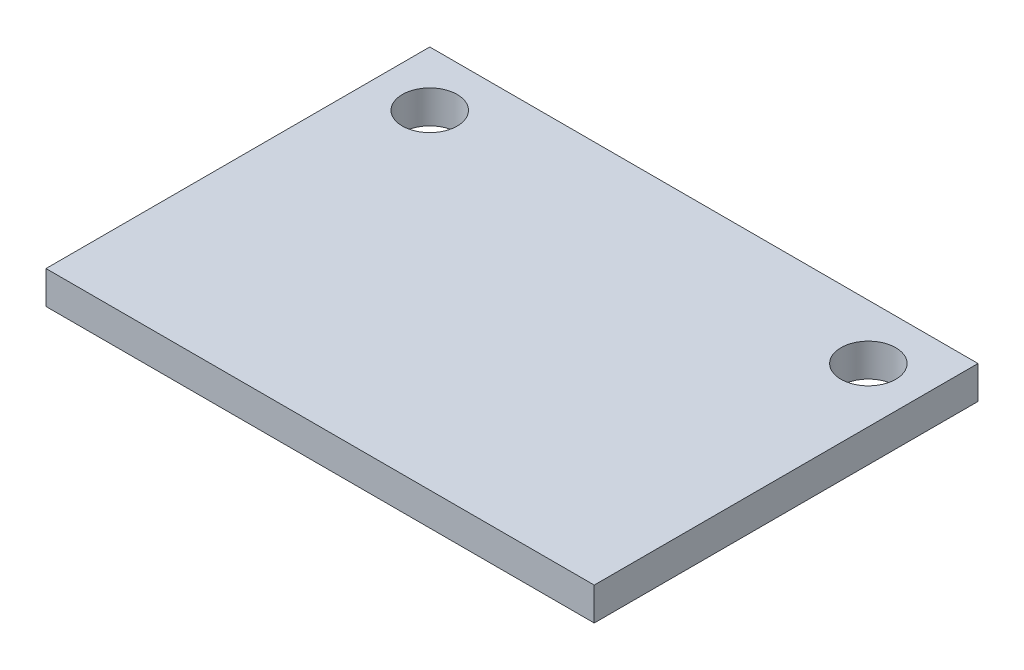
ISO-10303-21;
HEADER;
FILE_DESCRIPTION(('STEP AP214'),'2;1');
FILE_NAME('part.step','',(''),(''),'','','');
FILE_SCHEMA(('AUTOMOTIVE_DESIGN { 1 0 10303 214 1 1 1 1 }'));
ENDSEC;
DATA;
#1=APPLICATION_CONTEXT('core data for automotive mechanical design processes');
#2=APPLICATION_PROTOCOL_DEFINITION('international standard','automotive_design',2000,#1);
#3=PRODUCT_CONTEXT('',#1,'mechanical');
#4=PRODUCT('Part','Part','',(#3));
#5=PRODUCT_RELATED_PRODUCT_CATEGORY('part','',(#4));
#6=PRODUCT_DEFINITION_FORMATION('','',#4);
#7=PRODUCT_DEFINITION_CONTEXT('part definition',#1,'design');
#8=PRODUCT_DEFINITION('design','',#6,#7);
#9=PRODUCT_DEFINITION_SHAPE('','',#8);
#10=(LENGTH_UNIT() NAMED_UNIT(*) SI_UNIT(.MILLI.,.METRE.));
#11=(NAMED_UNIT(*) PLANE_ANGLE_UNIT() SI_UNIT($,.RADIAN.));
#12=(NAMED_UNIT(*) SI_UNIT($,.STERADIAN.) SOLID_ANGLE_UNIT());
#13=UNCERTAINTY_MEASURE_WITH_UNIT(LENGTH_MEASURE(1.E-05),#10,'distance_accuracy_value','');
#14=(GEOMETRIC_REPRESENTATION_CONTEXT(3) GLOBAL_UNCERTAINTY_ASSIGNED_CONTEXT((#13)) GLOBAL_UNIT_ASSIGNED_CONTEXT((#10,
#11,#12)) REPRESENTATION_CONTEXT('',''));
#15=CARTESIAN_POINT('',(0.,0.,0.));
#16=DIRECTION('',(0.,0.,1.));
#17=DIRECTION('',(1.,0.,0.));
#18=AXIS2_PLACEMENT_3D('',#15,#16,#17);
#19=CARTESIAN_POINT('',(0.,1.524,0.));
#20=DIRECTION('',(0.,1.,0.));
#21=DIRECTION('',(0.,0.,1.));
#22=AXIS2_PLACEMENT_3D('',#19,#20,#21);
#23=PLANE('',#22);
#24=CARTESIAN_POINT('',(-10.16,1.524,-6.35));
#25=DIRECTION('',(0.,1.,0.));
#26=DIRECTION('',(0.,0.,1.));
#27=AXIS2_PLACEMENT_3D('',#24,#25,#26);
#28=CIRCLE('',#27,1.27);
#29=CARTESIAN_POINT('',(-10.16,1.524,-7.62));
#30=VERTEX_POINT('',#29);
#31=EDGE_CURVE('E106',#30,#30,#28,.T.);
#32=ORIENTED_EDGE('',*,*,#31,.F.);
#33=EDGE_LOOP('',(#32));
#34=FACE_BOUND('',#33,.T.);
#35=DIRECTION('',(0.,0.,1.));
#36=VECTOR('',#35,1.);
#37=CARTESIAN_POINT('',(-12.7,1.524,-8.89));
#38=LINE('',#37,#36);
#39=CARTESIAN_POINT('',(-12.7,1.524,-8.89));
#40=VERTEX_POINT('',#39);
#41=CARTESIAN_POINT('',(-12.7,1.524,8.89));
#42=VERTEX_POINT('',#41);
#43=EDGE_CURVE('E91',#40,#42,#38,.T.);
#44=ORIENTED_EDGE('',*,*,#43,.T.);
#45=DIRECTION('',(1.,0.,0.));
#46=VECTOR('',#45,1.);
#47=CARTESIAN_POINT('',(-12.7,1.524,8.89));
#48=LINE('',#47,#46);
#49=CARTESIAN_POINT('',(12.7,1.524,8.89));
#50=VERTEX_POINT('',#49);
#51=EDGE_CURVE('E86',#42,#50,#48,.T.);
#52=ORIENTED_EDGE('',*,*,#51,.T.);
#53=DIRECTION('',(0.,0.,-1.));
#54=VECTOR('',#53,1.);
#55=CARTESIAN_POINT('',(12.7,1.524,-8.89));
#56=LINE('',#55,#54);
#57=CARTESIAN_POINT('',(12.7,1.524,-8.89));
#58=VERTEX_POINT('',#57);
#59=EDGE_CURVE('E89',#50,#58,#56,.T.);
#60=ORIENTED_EDGE('',*,*,#59,.T.);
#61=DIRECTION('',(-1.,0.,0.));
#62=VECTOR('',#61,1.);
#63=CARTESIAN_POINT('',(-12.7,1.524,-8.89));
#64=LINE('',#63,#62);
#65=EDGE_CURVE('E56',#58,#40,#64,.T.);
#66=ORIENTED_EDGE('',*,*,#65,.T.);
#67=EDGE_LOOP('',(#44,#52,#60,#66));
#68=FACE_BOUND('',#67,.T.);
#69=CARTESIAN_POINT('',(10.16,1.524,-6.35));
#70=DIRECTION('',(0.,1.,0.));
#71=DIRECTION('',(0.,0.,-1.));
#72=AXIS2_PLACEMENT_3D('',#69,#70,#71);
#73=CIRCLE('',#72,1.27);
#74=CARTESIAN_POINT('',(10.16,1.524,-7.62));
#75=VERTEX_POINT('',#74);
#76=EDGE_CURVE('E121',#75,#75,#73,.T.);
#77=ORIENTED_EDGE('',*,*,#76,.F.);
#78=EDGE_LOOP('',(#77));
#79=FACE_BOUND('',#78,.T.);
#80=ADVANCED_FACE('F39',(#34,#68,#79),#23,.T.);
#81=CARTESIAN_POINT('',(0.,0.,0.));
#82=DIRECTION('',(0.,1.,0.));
#83=DIRECTION('',(0.,0.,1.));
#84=AXIS2_PLACEMENT_3D('',#81,#82,#83);
#85=PLANE('',#84);
#86=DIRECTION('',(0.,0.,1.));
#87=VECTOR('',#86,1.);
#88=CARTESIAN_POINT('',(-12.7,0.,-8.89));
#89=LINE('',#88,#87);
#90=CARTESIAN_POINT('',(-12.7,0.,-8.89));
#91=VERTEX_POINT('',#90);
#92=CARTESIAN_POINT('',(-12.7,0.,8.89));
#93=VERTEX_POINT('',#92);
#94=EDGE_CURVE('E103',#91,#93,#89,.T.);
#95=ORIENTED_EDGE('',*,*,#94,.F.);
#96=DIRECTION('',(-1.,0.,0.));
#97=VECTOR('',#96,1.);
#98=CARTESIAN_POINT('',(-12.7,0.,-8.89));
#99=LINE('',#98,#97);
#100=CARTESIAN_POINT('',(12.7,0.,-8.89));
#101=VERTEX_POINT('',#100);
#102=EDGE_CURVE('E79',#101,#91,#99,.T.);
#103=ORIENTED_EDGE('',*,*,#102,.F.);
#104=DIRECTION('',(0.,0.,-1.));
#105=VECTOR('',#104,1.);
#106=CARTESIAN_POINT('',(12.7,0.,-8.89));
#107=LINE('',#106,#105);
#108=CARTESIAN_POINT('',(12.7,0.,8.89));
#109=VERTEX_POINT('',#108);
#110=EDGE_CURVE('E73',#109,#101,#107,.T.);
#111=ORIENTED_EDGE('',*,*,#110,.F.);
#112=DIRECTION('',(1.,0.,0.));
#113=VECTOR('',#112,1.);
#114=CARTESIAN_POINT('',(-12.7,0.,8.89));
#115=LINE('',#114,#113);
#116=EDGE_CURVE('E95',#93,#109,#115,.T.);
#117=ORIENTED_EDGE('',*,*,#116,.F.);
#118=EDGE_LOOP('',(#95,#103,#111,#117));
#119=FACE_BOUND('',#118,.T.);
#120=CARTESIAN_POINT('',(-10.16,0.,-6.35));
#121=DIRECTION('',(0.,1.,0.));
#122=DIRECTION('',(0.,0.,1.));
#123=AXIS2_PLACEMENT_3D('',#120,#121,#122);
#124=CIRCLE('',#123,1.27);
#125=CARTESIAN_POINT('',(-10.16,0.,-7.62));
#126=VERTEX_POINT('',#125);
#127=EDGE_CURVE('E118',#126,#126,#124,.T.);
#128=ORIENTED_EDGE('',*,*,#127,.T.);
#129=EDGE_LOOP('',(#128));
#130=FACE_BOUND('',#129,.T.);
#131=CARTESIAN_POINT('',(10.16,0.,-6.35));
#132=DIRECTION('',(0.,1.,0.));
#133=DIRECTION('',(0.,0.,-1.));
#134=AXIS2_PLACEMENT_3D('',#131,#132,#133);
#135=CIRCLE('',#134,1.27);
#136=CARTESIAN_POINT('',(10.16,0.,-7.62));
#137=VERTEX_POINT('',#136);
#138=EDGE_CURVE('E124',#137,#137,#135,.T.);
#139=ORIENTED_EDGE('',*,*,#138,.T.);
#140=EDGE_LOOP('',(#139));
#141=FACE_BOUND('',#140,.T.);
#142=ADVANCED_FACE('F114',(#119,#130,#141),#85,.F.);
#143=CARTESIAN_POINT('',(-12.7,1.524,-8.89));
#144=DIRECTION('',(1.,0.,0.));
#145=DIRECTION('',(0.,0.,-1.));
#146=AXIS2_PLACEMENT_3D('',#143,#144,#145);
#147=PLANE('',#146);
#148=ORIENTED_EDGE('',*,*,#94,.T.);
#149=DIRECTION('',(0.,-1.,0.));
#150=VECTOR('',#149,1.);
#151=CARTESIAN_POINT('',(-12.7,1.524,8.89));
#152=LINE('',#151,#150);
#153=EDGE_CURVE('E11',#42,#93,#152,.T.);
#154=ORIENTED_EDGE('',*,*,#153,.F.);
#155=ORIENTED_EDGE('',*,*,#43,.F.);
#156=DIRECTION('',(0.,-1.,0.));
#157=VECTOR('',#156,1.);
#158=CARTESIAN_POINT('',(-12.7,1.524,-8.89));
#159=LINE('',#158,#157);
#160=EDGE_CURVE('E99',#40,#91,#159,.T.);
#161=ORIENTED_EDGE('',*,*,#160,.T.);
#162=EDGE_LOOP('',(#148,#154,#155,#161));
#163=FACE_BOUND('',#162,.T.);
#164=ADVANCED_FACE('F41',(#163),#147,.F.);
#165=CARTESIAN_POINT('',(-12.7,1.524,8.89));
#166=DIRECTION('',(0.,0.,-1.));
#167=DIRECTION('',(-1.,0.,0.));
#168=AXIS2_PLACEMENT_3D('',#165,#166,#167);
#169=PLANE('',#168);
#170=ORIENTED_EDGE('',*,*,#116,.T.);
#171=DIRECTION('',(0.,-1.,0.));
#172=VECTOR('',#171,1.);
#173=CARTESIAN_POINT('',(12.7,1.524,8.89));
#174=LINE('',#173,#172);
#175=EDGE_CURVE('E48',#50,#109,#174,.T.);
#176=ORIENTED_EDGE('',*,*,#175,.F.);
#177=ORIENTED_EDGE('',*,*,#51,.F.);
#178=ORIENTED_EDGE('',*,*,#153,.T.);
#179=EDGE_LOOP('',(#170,#176,#177,#178));
#180=FACE_BOUND('',#179,.T.);
#181=ADVANCED_FACE('F94',(#180),#169,.F.);
#182=CARTESIAN_POINT('',(12.7,1.524,-8.89));
#183=DIRECTION('',(-1.,0.,0.));
#184=DIRECTION('',(0.,0.,1.));
#185=AXIS2_PLACEMENT_3D('',#182,#183,#184);
#186=PLANE('',#185);
#187=ORIENTED_EDGE('',*,*,#110,.T.);
#188=DIRECTION('',(0.,-1.,0.));
#189=VECTOR('',#188,1.);
#190=CARTESIAN_POINT('',(12.7,1.524,-8.89));
#191=LINE('',#190,#189);
#192=EDGE_CURVE('E96',#58,#101,#191,.T.);
#193=ORIENTED_EDGE('',*,*,#192,.F.);
#194=ORIENTED_EDGE('',*,*,#59,.F.);
#195=ORIENTED_EDGE('',*,*,#175,.T.);
#196=EDGE_LOOP('',(#187,#193,#194,#195));
#197=FACE_BOUND('',#196,.T.);
#198=ADVANCED_FACE('F97',(#197),#186,.F.);
#199=CARTESIAN_POINT('',(-12.7,1.524,-8.89));
#200=DIRECTION('',(0.,0.,1.));
#201=DIRECTION('',(1.,0.,0.));
#202=AXIS2_PLACEMENT_3D('',#199,#200,#201);
#203=PLANE('',#202);
#204=ORIENTED_EDGE('',*,*,#102,.T.);
#205=ORIENTED_EDGE('',*,*,#160,.F.);
#206=ORIENTED_EDGE('',*,*,#65,.F.);
#207=ORIENTED_EDGE('',*,*,#192,.T.);
#208=EDGE_LOOP('',(#204,#205,#206,#207));
#209=FACE_BOUND('',#208,.T.);
#210=ADVANCED_FACE('F111',(#209),#203,.F.);
#211=CARTESIAN_POINT('',(-10.16,1.524,-6.35));
#212=DIRECTION('',(0.,-1.,0.));
#213=DIRECTION('',(0.,0.,-1.));
#214=AXIS2_PLACEMENT_3D('',#211,#212,#213);
#215=CYLINDRICAL_SURFACE('',#214,1.27);
#216=CARTESIAN_POINT('',(-10.16,1.524,-7.62));
#217=CARTESIAN_POINT('',(-10.16,1.508125,-7.62));
#218=CARTESIAN_POINT('',(-10.16,1.49225,-7.62));
#219=CARTESIAN_POINT('',(-10.16,1.4605,-7.62));
#220=CARTESIAN_POINT('',(-10.16,1.444625,-7.62));
#221=CARTESIAN_POINT('',(-10.16,1.412875,-7.62));
#222=CARTESIAN_POINT('',(-10.16,1.397,-7.62));
#223=CARTESIAN_POINT('',(-10.16,1.36525,-7.62));
#224=CARTESIAN_POINT('',(-10.16,1.349375,-7.62));
#225=CARTESIAN_POINT('',(-10.16,1.317625,-7.62));
#226=CARTESIAN_POINT('',(-10.16,1.30175,-7.62));
#227=CARTESIAN_POINT('',(-10.16,1.27,-7.62));
#228=CARTESIAN_POINT('',(-10.16,1.254125,-7.62));
#229=CARTESIAN_POINT('',(-10.16,1.222375,-7.62));
#230=CARTESIAN_POINT('',(-10.16,1.2065,-7.62));
#231=CARTESIAN_POINT('',(-10.16,1.17475,-7.62));
#232=CARTESIAN_POINT('',(-10.16,1.158875,-7.62));
#233=CARTESIAN_POINT('',(-10.16,1.127125,-7.62));
#234=CARTESIAN_POINT('',(-10.16,1.11125,-7.62));
#235=CARTESIAN_POINT('',(-10.16,1.0795,-7.62));
#236=CARTESIAN_POINT('',(-10.16,1.063625,-7.62));
#237=CARTESIAN_POINT('',(-10.16,1.031875,-7.62));
#238=CARTESIAN_POINT('',(-10.16,1.016,-7.62));
#239=CARTESIAN_POINT('',(-10.16,0.98425,-7.62));
#240=CARTESIAN_POINT('',(-10.16,0.968375,-7.62));
#241=CARTESIAN_POINT('',(-10.16,0.936625,-7.62));
#242=CARTESIAN_POINT('',(-10.16,0.92075,-7.62));
#243=CARTESIAN_POINT('',(-10.16,0.889,-7.62));
#244=CARTESIAN_POINT('',(-10.16,0.873125,-7.62));
#245=CARTESIAN_POINT('',(-10.16,0.841375,-7.62));
#246=CARTESIAN_POINT('',(-10.16,0.8255,-7.62));
#247=CARTESIAN_POINT('',(-10.16,0.79375,-7.62));
#248=CARTESIAN_POINT('',(-10.16,0.777875,-7.62));
#249=CARTESIAN_POINT('',(-10.16,0.746125,-7.62));
#250=CARTESIAN_POINT('',(-10.16,0.73025,-7.62));
#251=CARTESIAN_POINT('',(-10.16,0.6985,-7.62));
#252=CARTESIAN_POINT('',(-10.16,0.682625,-7.62));
#253=CARTESIAN_POINT('',(-10.16,0.650875,-7.62));
#254=CARTESIAN_POINT('',(-10.16,0.635,-7.62));
#255=CARTESIAN_POINT('',(-10.16,0.60325,-7.62));
#256=CARTESIAN_POINT('',(-10.16,0.587375,-7.62));
#257=CARTESIAN_POINT('',(-10.16,0.555625,-7.62));
#258=CARTESIAN_POINT('',(-10.16,0.53975,-7.62));
#259=CARTESIAN_POINT('',(-10.16,0.508,-7.62));
#260=CARTESIAN_POINT('',(-10.16,0.492125,-7.62));
#261=CARTESIAN_POINT('',(-10.16,0.460375,-7.62));
#262=CARTESIAN_POINT('',(-10.16,0.4445,-7.62));
#263=CARTESIAN_POINT('',(-10.16,0.41275,-7.62));
#264=CARTESIAN_POINT('',(-10.16,0.396875,-7.62));
#265=CARTESIAN_POINT('',(-10.16,0.365125,-7.62));
#266=CARTESIAN_POINT('',(-10.16,0.34925,-7.62));
#267=CARTESIAN_POINT('',(-10.16,0.3175,-7.62));
#268=CARTESIAN_POINT('',(-10.16,0.301625,-7.62));
#269=CARTESIAN_POINT('',(-10.16,0.269875,-7.62));
#270=CARTESIAN_POINT('',(-10.16,0.254,-7.62));
#271=CARTESIAN_POINT('',(-10.16,0.22225,-7.62));
#272=CARTESIAN_POINT('',(-10.16,0.206375,-7.62));
#273=CARTESIAN_POINT('',(-10.16,0.174625,-7.62));
#274=CARTESIAN_POINT('',(-10.16,0.15875,-7.62));
#275=CARTESIAN_POINT('',(-10.16,0.127,-7.62));
#276=CARTESIAN_POINT('',(-10.16,0.111125,-7.62));
#277=CARTESIAN_POINT('',(-10.16,0.079375,-7.62));
#278=CARTESIAN_POINT('',(-10.16,0.0635,-7.62));
#279=CARTESIAN_POINT('',(-10.16,0.0317499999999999,-7.62));
#280=CARTESIAN_POINT('',(-10.16,0.015875,-7.62));
#281=CARTESIAN_POINT('',(-10.16,0.,-7.62));
#282=B_SPLINE_CURVE_WITH_KNOTS('',3,(#216,#217,#218,#219,#220,#221,#222,#223,#224,#225,#226,
#227,#228,#229,#230,#231,#232,#233,#234,#235,#236,#237,#238,#239,#240,#241,#242,#243,#244,#245,
#246,#247,#248,#249,#250,#251,#252,#253,#254,#255,#256,#257,#258,#259,#260,#261,#262,#263,#264,
#265,#266,#267,#268,#269,#270,#271,#272,#273,#274,#275,#276,#277,#278,#279,#280,#281),
.UNSPECIFIED.,.F.,.F.,(4,2,2,2,2,2,2,2,2,2,2,2,2,2,2,2,2,2,2,2,2,2,2,2,2,2,2,2,2,2,2,2,4),(0.,
0.0476249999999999,0.0952499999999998,0.142875,0.1905,0.238125,0.28575,0.333375,0.381,0.428625,
0.47625,0.523875,0.5715,0.619125,0.66675,0.714375,0.762,0.809625,0.85725,0.904875,0.9525,
1.000125,1.04775,1.095375,1.143,1.190625,1.23825,1.285875,1.3335,1.381125,1.42875,1.476375,
1.524),.UNSPECIFIED.);
#283=EDGE_CURVE('BSEAM141',#30,#126,#282,.T.);
#284=ORIENTED_EDGE('',*,*,#31,.T.);
#285=ORIENTED_EDGE('',*,*,#127,.F.);
#286=ORIENTED_EDGE('',*,*,#283,.T.);
#287=ORIENTED_EDGE('',*,*,#283,.F.);
#288=EDGE_LOOP('',(#284,#286,#285,#287));
#289=FACE_BOUND('',#288,.T.);
#290=ADVANCED_FACE('F141',(#289),#215,.F.);
#291=CARTESIAN_POINT('',(10.16,1.524,-6.35));
#292=DIRECTION('',(0.,-1.,0.));
#293=DIRECTION('',(0.,0.,-1.));
#294=AXIS2_PLACEMENT_3D('',#291,#292,#293);
#295=CYLINDRICAL_SURFACE('',#294,1.27);
#296=CARTESIAN_POINT('',(10.16,1.524,-7.62));
#297=CARTESIAN_POINT('',(10.16,1.508125,-7.62));
#298=CARTESIAN_POINT('',(10.16,1.49225,-7.62));
#299=CARTESIAN_POINT('',(10.16,1.4605,-7.62));
#300=CARTESIAN_POINT('',(10.16,1.444625,-7.62));
#301=CARTESIAN_POINT('',(10.16,1.412875,-7.62));
#302=CARTESIAN_POINT('',(10.16,1.397,-7.62));
#303=CARTESIAN_POINT('',(10.16,1.36525,-7.62));
#304=CARTESIAN_POINT('',(10.16,1.349375,-7.62));
#305=CARTESIAN_POINT('',(10.16,1.317625,-7.62));
#306=CARTESIAN_POINT('',(10.16,1.30175,-7.62));
#307=CARTESIAN_POINT('',(10.16,1.27,-7.62));
#308=CARTESIAN_POINT('',(10.16,1.254125,-7.62));
#309=CARTESIAN_POINT('',(10.16,1.222375,-7.62));
#310=CARTESIAN_POINT('',(10.16,1.2065,-7.62));
#311=CARTESIAN_POINT('',(10.16,1.17475,-7.62));
#312=CARTESIAN_POINT('',(10.16,1.158875,-7.62));
#313=CARTESIAN_POINT('',(10.16,1.127125,-7.62));
#314=CARTESIAN_POINT('',(10.16,1.11125,-7.62));
#315=CARTESIAN_POINT('',(10.16,1.0795,-7.62));
#316=CARTESIAN_POINT('',(10.16,1.063625,-7.62));
#317=CARTESIAN_POINT('',(10.16,1.031875,-7.62));
#318=CARTESIAN_POINT('',(10.16,1.016,-7.62));
#319=CARTESIAN_POINT('',(10.16,0.98425,-7.62));
#320=CARTESIAN_POINT('',(10.16,0.968375,-7.62));
#321=CARTESIAN_POINT('',(10.16,0.936625,-7.62));
#322=CARTESIAN_POINT('',(10.16,0.92075,-7.62));
#323=CARTESIAN_POINT('',(10.16,0.889,-7.62));
#324=CARTESIAN_POINT('',(10.16,0.873125,-7.62));
#325=CARTESIAN_POINT('',(10.16,0.841375,-7.62));
#326=CARTESIAN_POINT('',(10.16,0.8255,-7.62));
#327=CARTESIAN_POINT('',(10.16,0.79375,-7.62));
#328=CARTESIAN_POINT('',(10.16,0.777875,-7.62));
#329=CARTESIAN_POINT('',(10.16,0.746125,-7.62));
#330=CARTESIAN_POINT('',(10.16,0.73025,-7.62));
#331=CARTESIAN_POINT('',(10.16,0.6985,-7.62));
#332=CARTESIAN_POINT('',(10.16,0.682625,-7.62));
#333=CARTESIAN_POINT('',(10.16,0.650875,-7.62));
#334=CARTESIAN_POINT('',(10.16,0.635,-7.62));
#335=CARTESIAN_POINT('',(10.16,0.60325,-7.62));
#336=CARTESIAN_POINT('',(10.16,0.587375,-7.62));
#337=CARTESIAN_POINT('',(10.16,0.555625,-7.62));
#338=CARTESIAN_POINT('',(10.16,0.53975,-7.62));
#339=CARTESIAN_POINT('',(10.16,0.508,-7.62));
#340=CARTESIAN_POINT('',(10.16,0.492125,-7.62));
#341=CARTESIAN_POINT('',(10.16,0.460375,-7.62));
#342=CARTESIAN_POINT('',(10.16,0.4445,-7.62));
#343=CARTESIAN_POINT('',(10.16,0.41275,-7.62));
#344=CARTESIAN_POINT('',(10.16,0.396875,-7.62));
#345=CARTESIAN_POINT('',(10.16,0.365125,-7.62));
#346=CARTESIAN_POINT('',(10.16,0.34925,-7.62));
#347=CARTESIAN_POINT('',(10.16,0.3175,-7.62));
#348=CARTESIAN_POINT('',(10.16,0.301625,-7.62));
#349=CARTESIAN_POINT('',(10.16,0.269875,-7.62));
#350=CARTESIAN_POINT('',(10.16,0.254,-7.62));
#351=CARTESIAN_POINT('',(10.16,0.22225,-7.62));
#352=CARTESIAN_POINT('',(10.16,0.206375,-7.62));
#353=CARTESIAN_POINT('',(10.16,0.174625,-7.62));
#354=CARTESIAN_POINT('',(10.16,0.15875,-7.62));
#355=CARTESIAN_POINT('',(10.16,0.127,-7.62));
#356=CARTESIAN_POINT('',(10.16,0.111125,-7.62));
#357=CARTESIAN_POINT('',(10.16,0.079375,-7.62));
#358=CARTESIAN_POINT('',(10.16,0.0635,-7.62));
#359=CARTESIAN_POINT('',(10.16,0.0317499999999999,-7.62));
#360=CARTESIAN_POINT('',(10.16,0.015875,-7.62));
#361=CARTESIAN_POINT('',(10.16,0.,-7.62));
#362=B_SPLINE_CURVE_WITH_KNOTS('',3,(#296,#297,#298,#299,#300,#301,#302,#303,#304,#305,#306,
#307,#308,#309,#310,#311,#312,#313,#314,#315,#316,#317,#318,#319,#320,#321,#322,#323,#324,#325,
#326,#327,#328,#329,#330,#331,#332,#333,#334,#335,#336,#337,#338,#339,#340,#341,#342,#343,#344,
#345,#346,#347,#348,#349,#350,#351,#352,#353,#354,#355,#356,#357,#358,#359,#360,#361),
.UNSPECIFIED.,.F.,.F.,(4,2,2,2,2,2,2,2,2,2,2,2,2,2,2,2,2,2,2,2,2,2,2,2,2,2,2,2,2,2,2,2,4),(0.,
0.0476249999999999,0.0952499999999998,0.142875,0.1905,0.238125,0.28575,0.333375,0.381,0.428625,
0.47625,0.523875,0.5715,0.619125,0.66675,0.714375,0.762,0.809625,0.85725,0.904875,0.9525,
1.000125,1.04775,1.095375,1.143,1.190625,1.23825,1.285875,1.3335,1.381125,1.42875,1.476375,
1.524),.UNSPECIFIED.);
#363=EDGE_CURVE('BSEAM130',#75,#137,#362,.T.);
#364=ORIENTED_EDGE('',*,*,#76,.T.);
#365=ORIENTED_EDGE('',*,*,#138,.F.);
#366=ORIENTED_EDGE('',*,*,#363,.T.);
#367=ORIENTED_EDGE('',*,*,#363,.F.);
#368=EDGE_LOOP('',(#364,#366,#365,#367));
#369=FACE_BOUND('',#368,.T.);
#370=ADVANCED_FACE('F130',(#369),#295,.F.);
#371=CLOSED_SHELL('',(#80,#142,#164,#181,#198,#210,#290,#370));
#372=MANIFOLD_SOLID_BREP('B2',#371);
#373=ADVANCED_BREP_SHAPE_REPRESENTATION('',(#18,#372),#14);
#374=SHAPE_DEFINITION_REPRESENTATION(#9,#373);
ENDSEC;
END-ISO-10303-21;
